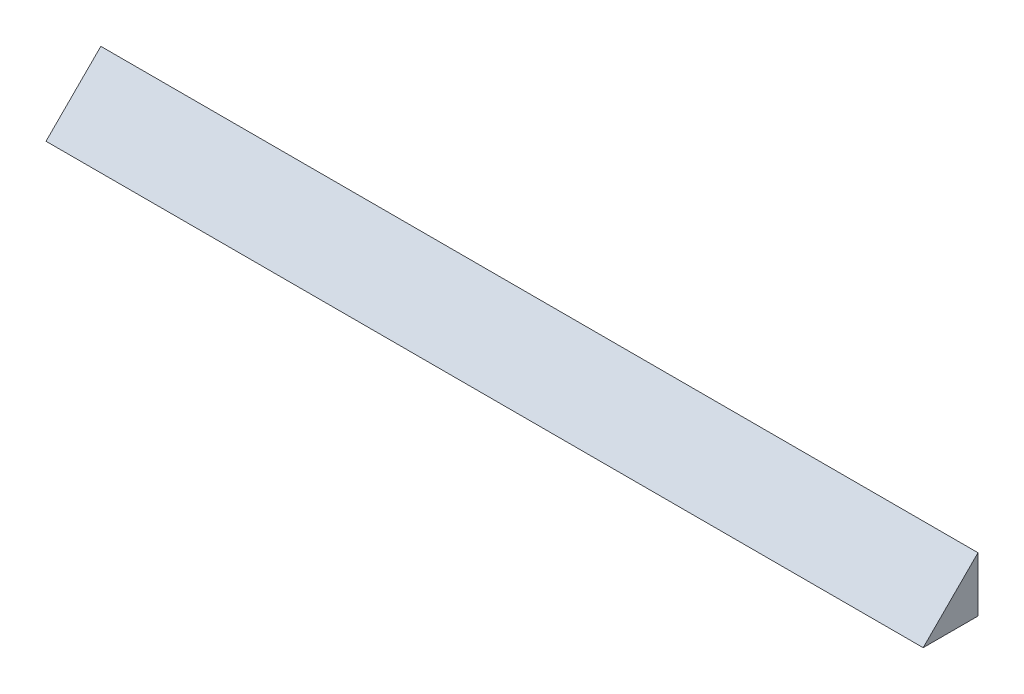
ISO-10303-21;
HEADER;
FILE_DESCRIPTION(('STEP AP214'),'2;1');
FILE_NAME('part.step','',(''),(''),'','','');
FILE_SCHEMA(('AUTOMOTIVE_DESIGN { 1 0 10303 214 1 1 1 1 }'));
ENDSEC;
DATA;
#1=APPLICATION_CONTEXT('core data for automotive mechanical design processes');
#2=APPLICATION_PROTOCOL_DEFINITION('international standard','automotive_design',2000,#1);
#3=PRODUCT_CONTEXT('',#1,'mechanical');
#4=PRODUCT('Part','Part','',(#3));
#5=PRODUCT_RELATED_PRODUCT_CATEGORY('part','',(#4));
#6=PRODUCT_DEFINITION_FORMATION('','',#4);
#7=PRODUCT_DEFINITION_CONTEXT('part definition',#1,'design');
#8=PRODUCT_DEFINITION('design','',#6,#7);
#9=PRODUCT_DEFINITION_SHAPE('','',#8);
#10=(LENGTH_UNIT() NAMED_UNIT(*) SI_UNIT(.MILLI.,.METRE.));
#11=(NAMED_UNIT(*) PLANE_ANGLE_UNIT() SI_UNIT($,.RADIAN.));
#12=(NAMED_UNIT(*) SI_UNIT($,.STERADIAN.) SOLID_ANGLE_UNIT());
#13=UNCERTAINTY_MEASURE_WITH_UNIT(LENGTH_MEASURE(1.E-05),#10,'distance_accuracy_value','');
#14=(GEOMETRIC_REPRESENTATION_CONTEXT(3) GLOBAL_UNCERTAINTY_ASSIGNED_CONTEXT((#13)) GLOBAL_UNIT_ASSIGNED_CONTEXT((#10,
#11,#12)) REPRESENTATION_CONTEXT('',''));
#15=CARTESIAN_POINT('',(0.,0.,0.));
#16=DIRECTION('',(0.,0.,1.));
#17=DIRECTION('',(1.,0.,0.));
#18=AXIS2_PLACEMENT_3D('',#15,#16,#17);
#19=CARTESIAN_POINT('',(378.796,-48.382,120.));
#20=DIRECTION('',(0.,0.,-1.));
#21=DIRECTION('',(0.,1.,0.));
#22=AXIS2_PLACEMENT_3D('',#19,#20,#21);
#23=PLANE('',#22);
#24=DIRECTION('',(0.,-1.,0.));
#25=VECTOR('',#24,1.);
#26=CARTESIAN_POINT('',(-294.204,-58.3819999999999,120.));
#27=LINE('',#26,#25);
#28=CARTESIAN_POINT('',(-294.204,-38.3819999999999,120.));
#29=VERTEX_POINT('',#28);
#30=CARTESIAN_POINT('',(-294.204,-48.382,120.));
#31=VERTEX_POINT('',#30);
#32=EDGE_CURVE('E76',#29,#31,#27,.T.);
#33=ORIENTED_EDGE('',*,*,#32,.T.);
#34=DIRECTION('',(-1.,0.,0.));
#35=VECTOR('',#34,1.);
#36=CARTESIAN_POINT('',(378.796,-48.382,120.));
#37=LINE('',#36,#35);
#38=CARTESIAN_POINT('',(-454.204,-48.3819999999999,120.));
#39=VERTEX_POINT('',#38);
#40=EDGE_CURVE('E68',#31,#39,#37,.T.);
#41=ORIENTED_EDGE('',*,*,#40,.T.);
#42=DIRECTION('',(0.,1.,0.));
#43=VECTOR('',#42,1.);
#44=CARTESIAN_POINT('',(-454.204,-58.382,120.));
#45=LINE('',#44,#43);
#46=CARTESIAN_POINT('',(-454.204,-38.3819999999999,120.));
#47=VERTEX_POINT('',#46);
#48=EDGE_CURVE('E83',#39,#47,#45,.T.);
#49=ORIENTED_EDGE('',*,*,#48,.T.);
#50=DIRECTION('',(1.,0.,0.));
#51=VECTOR('',#50,1.);
#52=CARTESIAN_POINT('',(-294.204,-38.3819999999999,120.));
#53=LINE('',#52,#51);
#54=EDGE_CURVE('E37',#47,#29,#53,.T.);
#55=ORIENTED_EDGE('',*,*,#54,.T.);
#56=EDGE_LOOP('',(#33,#41,#49,#55));
#57=FACE_BOUND('',#56,.T.);
#58=ADVANCED_FACE('F33',(#57),#23,.T.);
#59=CARTESIAN_POINT('',(-294.204,-48.3819999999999,120.));
#60=DIRECTION('',(-1.,0.,0.));
#61=DIRECTION('',(0.,-1.,0.));
#62=AXIS2_PLACEMENT_3D('',#59,#60,#61);
#63=PLANE('',#62);
#64=ORIENTED_EDGE('',*,*,#32,.F.);
#65=DIRECTION('',(0.,0.707106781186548,-0.707106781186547));
#66=VECTOR('',#65,1.);
#67=CARTESIAN_POINT('',(-294.204,-48.3819999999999,130.));
#68=LINE('',#67,#66);
#69=CARTESIAN_POINT('',(-294.204,-48.3819999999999,130.));
#70=VERTEX_POINT('',#69);
#71=EDGE_CURVE('E82',#70,#29,#68,.T.);
#72=ORIENTED_EDGE('',*,*,#71,.F.);
#73=DIRECTION('',(0.,0.,1.));
#74=VECTOR('',#73,1.);
#75=CARTESIAN_POINT('',(-294.204,-48.3819999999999,-175.));
#76=LINE('',#75,#74);
#77=EDGE_CURVE('E73',#31,#70,#76,.T.);
#78=ORIENTED_EDGE('',*,*,#77,.F.);
#79=EDGE_LOOP('',(#64,#72,#78));
#80=FACE_BOUND('',#79,.T.);
#81=ADVANCED_FACE('F81',(#80),#63,.F.);
#82=CARTESIAN_POINT('',(-454.204,-48.3819999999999,-175.));
#83=DIRECTION('',(0.,-1.,0.));
#84=DIRECTION('',(0.,0.,1.));
#85=AXIS2_PLACEMENT_3D('',#82,#83,#84);
#86=PLANE('',#85);
#87=DIRECTION('',(-1.,0.,0.));
#88=VECTOR('',#87,1.);
#89=CARTESIAN_POINT('',(-454.204,-48.3819999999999,130.));
#90=LINE('',#89,#88);
#91=CARTESIAN_POINT('',(-454.204,-48.3819999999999,130.));
#92=VERTEX_POINT('',#91);
#93=EDGE_CURVE('E42',#70,#92,#90,.T.);
#94=ORIENTED_EDGE('',*,*,#93,.T.);
#95=DIRECTION('',(0.,0.,-1.));
#96=VECTOR('',#95,1.);
#97=CARTESIAN_POINT('',(-454.204,-48.3819999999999,-175.));
#98=LINE('',#97,#96);
#99=EDGE_CURVE('E55',#92,#39,#98,.T.);
#100=ORIENTED_EDGE('',*,*,#99,.T.);
#101=ORIENTED_EDGE('',*,*,#40,.F.);
#102=ORIENTED_EDGE('',*,*,#77,.T.);
#103=EDGE_LOOP('',(#94,#100,#101,#102));
#104=FACE_BOUND('',#103,.T.);
#105=ADVANCED_FACE('F71',(#104),#86,.T.);
#106=CARTESIAN_POINT('',(-454.204,-48.3819999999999,120.));
#107=DIRECTION('',(-1.,0.,0.));
#108=DIRECTION('',(0.,-1.,0.));
#109=AXIS2_PLACEMENT_3D('',#106,#107,#108);
#110=PLANE('',#109);
#111=ORIENTED_EDGE('',*,*,#48,.F.);
#112=ORIENTED_EDGE('',*,*,#99,.F.);
#113=DIRECTION('',(0.,0.707106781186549,-0.707106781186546));
#114=VECTOR('',#113,1.);
#115=CARTESIAN_POINT('',(-454.204,-48.3819999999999,130.));
#116=LINE('',#115,#114);
#117=EDGE_CURVE('E11',#92,#47,#116,.T.);
#118=ORIENTED_EDGE('',*,*,#117,.T.);
#119=EDGE_LOOP('',(#111,#112,#118));
#120=FACE_BOUND('',#119,.T.);
#121=ADVANCED_FACE('F89',(#120),#110,.T.);
#122=CARTESIAN_POINT('',(-294.204,-38.3819999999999,120.));
#123=DIRECTION('',(0.,0.707106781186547,0.707106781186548));
#124=DIRECTION('',(0.,-0.707106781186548,0.707106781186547));
#125=AXIS2_PLACEMENT_3D('',#122,#123,#124);
#126=PLANE('',#125);
#127=ORIENTED_EDGE('',*,*,#54,.F.);
#128=ORIENTED_EDGE('',*,*,#117,.F.);
#129=ORIENTED_EDGE('',*,*,#93,.F.);
#130=ORIENTED_EDGE('',*,*,#71,.T.);
#131=EDGE_LOOP('',(#127,#128,#129,#130));
#132=FACE_BOUND('',#131,.T.);
#133=ADVANCED_FACE('F35',(#132),#126,.T.);
#134=CLOSED_SHELL('',(#58,#81,#105,#121,#133));
#135=MANIFOLD_SOLID_BREP('B2',#134);
#136=ADVANCED_BREP_SHAPE_REPRESENTATION('',(#18,#135),#14);
#137=SHAPE_DEFINITION_REPRESENTATION(#9,#136);
ENDSEC;
END-ISO-10303-21;
